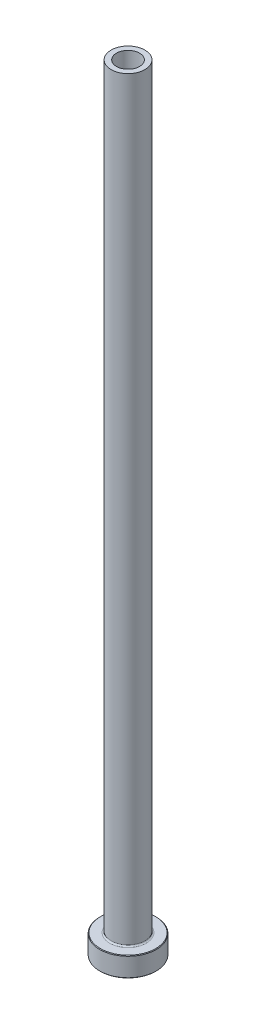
from build123d import *

# Parameters (mm, degrees)
FILLET1_R     = 0.5
CHAMFER1_SIZE = 0.2
CHAMFER3_SIZE = 0.5


with BuildPart() as part:
    # Sketch1 → Revolve1 (revolve)
    with BuildSketch(Plane.XY, mode=Mode.PRIVATE) as revolve1_sk:
        Polygon((-4.1, 275), (-6, 275), (-6, 7), (-10, 7), (-10, 0), (-4.35, 0), (-4.35, 218), (-4.1, 230), align=None)
    revolve(revolve1_sk.sketch.rotate(Axis((0, 92.187680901, 0), (0, -1, 0)), 270), axis=Axis((0, 92.187680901, 0), (0, -1, 0)))

    # Fillet1
    fillet1_edges = [part.edges().sort_by_distance(p)[0] for p in [
        (0, 7, -6),
    ]]
    fillet(fillet1_edges, radius=FILLET1_R)

    # Chamfer1
    chamfer1_edges = [part.edges().sort_by_distance(p)[0] for p in [
        (0, 0, -10),
        (0, 7, -10),
    ]]
    chamfer(chamfer1_edges, length=CHAMFER1_SIZE)

    # Chamfer3
    chamfer3_edges = [part.edges().sort_by_distance(p)[0] for p in [
        (0, 0, -4.35),
    ]]
    chamfer(chamfer3_edges, length=CHAMFER3_SIZE)


solid = part.part
